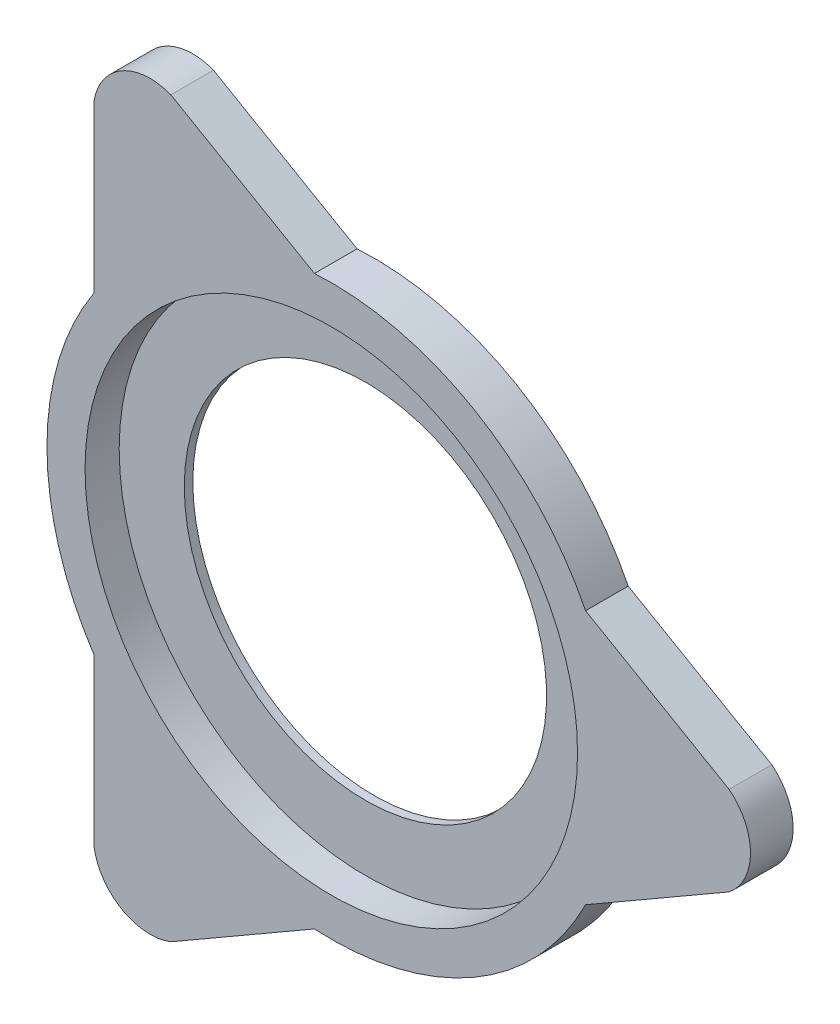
from build123d import *

# Parameters (mm, degrees)
SKETCH1_R          = 40.456394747
BASE_EXTRUDE_DEPTH = 9.525
SKETCH2_R          = 54.991944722
CUT_EXTRUDE1_DEPTH = 7.62


with BuildPart() as part:
    # Sketch1 → Base-Extrude (new body)
    with BuildSketch(Plane.XY):
        with BuildLine():
            Line((88.84522521, -9.917986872), (56.779605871, -28.43108083))
            ThreePointArc((56.779605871, -28.43108083), (31.75, -54.99261314), (-3.76776468, -63.388121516))
            Line((-3.76776468, -63.388121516), (-35.833384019, -81.901215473))
            ThreePointArc((-35.833384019, -81.901215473), (-46.806394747, -81.07105382), (-53.011841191, -71.983228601))
            Line((-53.011841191, -71.983228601), (-53.011841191, -34.957040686))
            ThreePointArc((-53.011841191, -34.957040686), (-63.5, 0), (-53.011841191, 34.957040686))
            Line((-53.011841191, 34.957040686), (-53.011841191, 71.983228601))
            ThreePointArc((-53.011841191, 71.983228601), (-46.806394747, 81.07105382), (-35.833384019, 81.901215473))
            Line((-35.833384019, 81.901215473), (-3.76776468, 63.388121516))
            ThreePointArc((-3.76776468, 63.388121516), (31.75, 54.99261314), (56.779605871, 28.43108083))
            Line((56.779605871, 28.43108083), (88.84522521, 9.917986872))
            ThreePointArc((88.84522521, 9.917986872), (93.612789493, 0), (88.84522521, -9.917986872))
        make_face()
        with Locations(Location((0, 0, 0), (0, 0, 180))):
            Circle(SKETCH1_R, mode=Mode.SUBTRACT)
    extrude(amount=BASE_EXTRUDE_DEPTH)

    # Sketch2 → Cut-Extrude1 (cut)
    with BuildSketch(Plane.XY.offset(9.525)):
        Circle(SKETCH2_R)
    extrude(amount=-CUT_EXTRUDE1_DEPTH, mode=Mode.SUBTRACT)


solid = part.part
